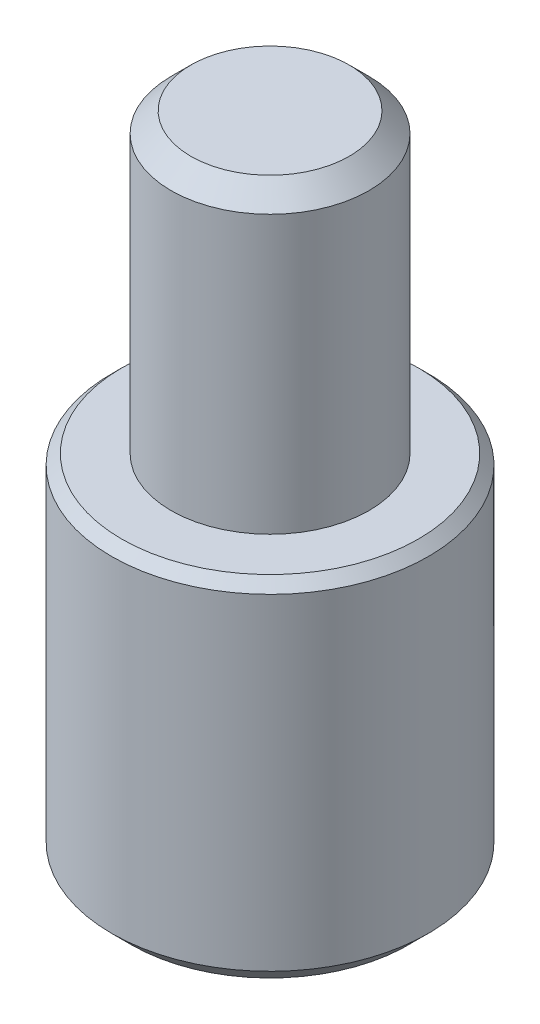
ISO-10303-21;
HEADER;
FILE_DESCRIPTION(('STEP AP214'),'2;1');
FILE_NAME('part.step','',(''),(''),'','','');
FILE_SCHEMA(('AUTOMOTIVE_DESIGN { 1 0 10303 214 1 1 1 1 }'));
ENDSEC;
DATA;
#1=APPLICATION_CONTEXT('core data for automotive mechanical design processes');
#2=APPLICATION_PROTOCOL_DEFINITION('international standard','automotive_design',2000,#1);
#3=PRODUCT_CONTEXT('',#1,'mechanical');
#4=PRODUCT('Part','Part','',(#3));
#5=PRODUCT_RELATED_PRODUCT_CATEGORY('part','',(#4));
#6=PRODUCT_DEFINITION_FORMATION('','',#4);
#7=PRODUCT_DEFINITION_CONTEXT('part definition',#1,'design');
#8=PRODUCT_DEFINITION('design','',#6,#7);
#9=PRODUCT_DEFINITION_SHAPE('','',#8);
#10=(LENGTH_UNIT() NAMED_UNIT(*) SI_UNIT(.MILLI.,.METRE.));
#11=(NAMED_UNIT(*) PLANE_ANGLE_UNIT() SI_UNIT($,.RADIAN.));
#12=(NAMED_UNIT(*) SI_UNIT($,.STERADIAN.) SOLID_ANGLE_UNIT());
#13=UNCERTAINTY_MEASURE_WITH_UNIT(LENGTH_MEASURE(1.E-05),#10,'distance_accuracy_value','');
#14=(GEOMETRIC_REPRESENTATION_CONTEXT(3) GLOBAL_UNCERTAINTY_ASSIGNED_CONTEXT((#13)) GLOBAL_UNIT_ASSIGNED_CONTEXT((#10,
#11,#12)) REPRESENTATION_CONTEXT('',''));
#15=CARTESIAN_POINT('',(0.,0.,0.));
#16=DIRECTION('',(0.,0.,1.));
#17=DIRECTION('',(1.,0.,0.));
#18=AXIS2_PLACEMENT_3D('',#15,#16,#17);
#19=CARTESIAN_POINT('',(0.,9.,0.));
#20=DIRECTION('',(0.,1.,0.));
#21=DIRECTION('',(0.,0.,1.));
#22=AXIS2_PLACEMENT_3D('',#19,#20,#21);
#23=PLANE('',#22);
#24=CARTESIAN_POINT('',(0.,9.,0.));
#25=DIRECTION('',(0.,1.,0.));
#26=DIRECTION('',(0.,0.,1.));
#27=AXIS2_PLACEMENT_3D('',#24,#25,#26);
#28=CIRCLE('',#27,3.746);
#29=CARTESIAN_POINT('',(0.,9.,3.746));
#30=VERTEX_POINT('',#29);
#31=EDGE_CURVE('E145',#30,#30,#28,.T.);
#32=ORIENTED_EDGE('',*,*,#31,.T.);
#33=EDGE_LOOP('',(#32));
#34=FACE_BOUND('',#33,.T.);
#35=CARTESIAN_POINT('',(0.,9.,0.));
#36=DIRECTION('',(0.,1.,0.));
#37=DIRECTION('',(0.,0.,1.));
#38=AXIS2_PLACEMENT_3D('',#35,#36,#37);
#39=CIRCLE('',#38,2.5);
#40=CARTESIAN_POINT('',(0.,9.,2.5));
#41=VERTEX_POINT('',#40);
#42=EDGE_CURVE('E137',#41,#41,#39,.T.);
#43=ORIENTED_EDGE('',*,*,#42,.F.);
#44=EDGE_LOOP('',(#43));
#45=FACE_BOUND('',#44,.T.);
#46=ADVANCED_FACE('F35',(#34,#45),#23,.T.);
#47=CARTESIAN_POINT('',(0.,9.,0.));
#48=DIRECTION('',(0.,-1.,0.));
#49=DIRECTION('',(0.,0.,-1.));
#50=AXIS2_PLACEMENT_3D('',#47,#48,#49);
#51=CYLINDRICAL_SURFACE('',#50,4.);
#52=CARTESIAN_POINT('',(0.,0.5,0.));
#53=DIRECTION('',(0.,1.,0.));
#54=DIRECTION('',(0.,0.,1.));
#55=AXIS2_PLACEMENT_3D('',#52,#53,#54);
#56=CIRCLE('',#55,4.);
#57=CARTESIAN_POINT('',(0.,0.5,4.));
#58=VERTEX_POINT('',#57);
#59=EDGE_CURVE('E151',#58,#58,#56,.T.);
#60=ORIENTED_EDGE('',*,*,#59,.T.);
#61=EDGE_LOOP('',(#60));
#62=FACE_BOUND('',#61,.T.);
#63=CARTESIAN_POINT('',(0.,8.746,0.));
#64=DIRECTION('',(0.,1.,0.));
#65=DIRECTION('',(0.,0.,1.));
#66=AXIS2_PLACEMENT_3D('',#63,#64,#65);
#67=CIRCLE('',#66,4.);
#68=CARTESIAN_POINT('',(0.,8.746,4.));
#69=VERTEX_POINT('',#68);
#70=EDGE_CURVE('E148',#69,#69,#67,.F.);
#71=ORIENTED_EDGE('',*,*,#70,.T.);
#72=EDGE_LOOP('',(#71));
#73=FACE_BOUND('',#72,.T.);
#74=ADVANCED_FACE('F170',(#62,#73),#51,.T.);
#75=CARTESIAN_POINT('',(0.,0.,0.));
#76=DIRECTION('',(0.,1.,0.));
#77=DIRECTION('',(0.,0.,1.));
#78=AXIS2_PLACEMENT_3D('',#75,#76,#77);
#79=PLANE('',#78);
#80=CARTESIAN_POINT('',(0.,0.,0.));
#81=DIRECTION('',(0.,1.,0.));
#82=DIRECTION('',(0.,0.,1.));
#83=AXIS2_PLACEMENT_3D('',#80,#81,#82);
#84=CIRCLE('',#83,3.5);
#85=CARTESIAN_POINT('',(0.,0.,3.5));
#86=VERTEX_POINT('',#85);
#87=EDGE_CURVE('E154',#86,#86,#84,.F.);
#88=ORIENTED_EDGE('',*,*,#87,.T.);
#89=EDGE_LOOP('',(#88));
#90=FACE_BOUND('',#89,.T.);
#91=DIRECTION('',(-1.,0.,0.));
#92=VECTOR('',#91,1.);
#93=CARTESIAN_POINT('',(0.866025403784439,0.,1.5));
#94=LINE('',#93,#92);
#95=CARTESIAN_POINT('',(0.866025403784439,0.,1.5));
#96=VERTEX_POINT('',#95);
#97=CARTESIAN_POINT('',(-0.866025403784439,0.,1.5));
#98=VERTEX_POINT('',#97);
#99=EDGE_CURVE('E124',#96,#98,#94,.T.);
#100=ORIENTED_EDGE('',*,*,#99,.F.);
#101=DIRECTION('',(-0.5,0.,0.866025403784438));
#102=VECTOR('',#101,1.);
#103=CARTESIAN_POINT('',(1.73205080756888,0.,0.));
#104=LINE('',#103,#102);
#105=CARTESIAN_POINT('',(1.73205080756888,0.,0.));
#106=VERTEX_POINT('',#105);
#107=EDGE_CURVE('E50',#106,#96,#104,.T.);
#108=ORIENTED_EDGE('',*,*,#107,.F.);
#109=DIRECTION('',(0.5,0.,0.866025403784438));
#110=VECTOR('',#109,1.);
#111=CARTESIAN_POINT('',(0.866025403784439,0.,-1.5));
#112=LINE('',#111,#110);
#113=CARTESIAN_POINT('',(0.866025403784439,0.,-1.5));
#114=VERTEX_POINT('',#113);
#115=EDGE_CURVE('E133',#114,#106,#112,.T.);
#116=ORIENTED_EDGE('',*,*,#115,.F.);
#117=DIRECTION('',(1.,0.,0.));
#118=VECTOR('',#117,1.);
#119=CARTESIAN_POINT('',(-0.866025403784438,0.,-1.5));
#120=LINE('',#119,#118);
#121=CARTESIAN_POINT('',(-0.866025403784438,0.,-1.5));
#122=VERTEX_POINT('',#121);
#123=EDGE_CURVE('E131',#122,#114,#120,.T.);
#124=ORIENTED_EDGE('',*,*,#123,.F.);
#125=DIRECTION('',(0.5,0.,-0.866025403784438));
#126=VECTOR('',#125,1.);
#127=CARTESIAN_POINT('',(-1.73205080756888,0.,0.));
#128=LINE('',#127,#126);
#129=CARTESIAN_POINT('',(-1.73205080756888,0.,0.));
#130=VERTEX_POINT('',#129);
#131=EDGE_CURVE('E98',#130,#122,#128,.T.);
#132=ORIENTED_EDGE('',*,*,#131,.F.);
#133=DIRECTION('',(-0.5,0.,-0.866025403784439));
#134=VECTOR('',#133,1.);
#135=CARTESIAN_POINT('',(-0.866025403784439,0.,1.5));
#136=LINE('',#135,#134);
#137=EDGE_CURVE('E127',#98,#130,#136,.T.);
#138=ORIENTED_EDGE('',*,*,#137,.F.);
#139=EDGE_LOOP('',(#100,#108,#116,#124,#132,#138));
#140=FACE_BOUND('',#139,.T.);
#141=ADVANCED_FACE('F176',(#90,#140),#79,.F.);
#142=CARTESIAN_POINT('',(0.,16.5,0.));
#143=DIRECTION('',(0.,-1.,0.));
#144=DIRECTION('',(0.,0.,-1.));
#145=AXIS2_PLACEMENT_3D('',#142,#143,#144);
#146=CYLINDRICAL_SURFACE('',#145,2.5);
#147=CARTESIAN_POINT('',(0.,16.,0.));
#148=DIRECTION('',(0.,1.,0.));
#149=DIRECTION('',(0.,0.,1.));
#150=AXIS2_PLACEMENT_3D('',#147,#148,#149);
#151=CIRCLE('',#150,2.5);
#152=CARTESIAN_POINT('',(0.,16.,2.5));
#153=VERTEX_POINT('',#152);
#154=EDGE_CURVE('E11',#153,#153,#151,.F.);
#155=ORIENTED_EDGE('',*,*,#154,.T.);
#156=EDGE_LOOP('',(#155));
#157=FACE_BOUND('',#156,.T.);
#158=ORIENTED_EDGE('',*,*,#42,.T.);
#159=EDGE_LOOP('',(#158));
#160=FACE_BOUND('',#159,.T.);
#161=ADVANCED_FACE('F182',(#157,#160),#146,.T.);
#162=CARTESIAN_POINT('',(0.,16.5,0.));
#163=DIRECTION('',(0.,1.,0.));
#164=DIRECTION('',(0.,0.,1.));
#165=AXIS2_PLACEMENT_3D('',#162,#163,#164);
#166=PLANE('',#165);
#167=CARTESIAN_POINT('',(0.,16.5,0.));
#168=DIRECTION('',(0.,1.,0.));
#169=DIRECTION('',(0.,0.,1.));
#170=AXIS2_PLACEMENT_3D('',#167,#168,#169);
#171=CIRCLE('',#170,2.);
#172=CARTESIAN_POINT('',(0.,16.5,2.));
#173=VERTEX_POINT('',#172);
#174=EDGE_CURVE('E43',#173,#173,#171,.T.);
#175=ORIENTED_EDGE('',*,*,#174,.T.);
#176=EDGE_LOOP('',(#175));
#177=FACE_BOUND('',#176,.T.);
#178=ADVANCED_FACE('F159',(#177),#166,.T.);
#179=CARTESIAN_POINT('',(0.,9.,0.));
#180=DIRECTION('',(0.,-1.,0.));
#181=DIRECTION('',(0.,0.,-1.));
#182=AXIS2_PLACEMENT_3D('',#179,#180,#181);
#183=CONICAL_SURFACE('',#182,3.746,0.785398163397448);
#184=ORIENTED_EDGE('',*,*,#70,.F.);
#185=EDGE_LOOP('',(#184));
#186=FACE_BOUND('',#185,.T.);
#187=ORIENTED_EDGE('',*,*,#31,.F.);
#188=EDGE_LOOP('',(#187));
#189=FACE_BOUND('',#188,.T.);
#190=ADVANCED_FACE('F187',(#186,#189),#183,.T.);
#191=CARTESIAN_POINT('',(1.73205080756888,3.3,0.));
#192=DIRECTION('',(0.866025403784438,0.,0.5));
#193=DIRECTION('',(0.5,0.,-0.866025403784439));
#194=AXIS2_PLACEMENT_3D('',#191,#192,#193);
#195=PLANE('',#194);
#196=ORIENTED_EDGE('',*,*,#107,.T.);
#197=DIRECTION('',(0.,-1.,0.));
#198=VECTOR('',#197,1.);
#199=CARTESIAN_POINT('',(0.866025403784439,3.3,1.5));
#200=LINE('',#199,#198);
#201=CARTESIAN_POINT('',(0.866025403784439,3.3,1.5));
#202=VERTEX_POINT('',#201);
#203=EDGE_CURVE('E80',#202,#96,#200,.T.);
#204=ORIENTED_EDGE('',*,*,#203,.F.);
#205=DIRECTION('',(-0.5,0.,0.866025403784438));
#206=VECTOR('',#205,1.);
#207=CARTESIAN_POINT('',(1.73205080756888,3.3,0.));
#208=LINE('',#207,#206);
#209=CARTESIAN_POINT('',(1.73205080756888,3.3,0.));
#210=VERTEX_POINT('',#209);
#211=EDGE_CURVE('E135',#210,#202,#208,.T.);
#212=ORIENTED_EDGE('',*,*,#211,.F.);
#213=DIRECTION('',(0.,-1.,0.));
#214=VECTOR('',#213,1.);
#215=CARTESIAN_POINT('',(1.73205080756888,3.3,0.));
#216=LINE('',#215,#214);
#217=EDGE_CURVE('E58',#210,#106,#216,.T.);
#218=ORIENTED_EDGE('',*,*,#217,.T.);
#219=EDGE_LOOP('',(#196,#204,#212,#218));
#220=FACE_BOUND('',#219,.T.);
#221=ADVANCED_FACE('F189',(#220),#195,.F.);
#222=CARTESIAN_POINT('',(0.866025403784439,3.3,-1.5));
#223=DIRECTION('',(0.866025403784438,0.,-0.5));
#224=DIRECTION('',(-0.5,0.,-0.866025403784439));
#225=AXIS2_PLACEMENT_3D('',#222,#223,#224);
#226=PLANE('',#225);
#227=ORIENTED_EDGE('',*,*,#115,.T.);
#228=ORIENTED_EDGE('',*,*,#217,.F.);
#229=DIRECTION('',(0.5,0.,0.866025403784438));
#230=VECTOR('',#229,1.);
#231=CARTESIAN_POINT('',(0.866025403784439,3.3,-1.5));
#232=LINE('',#231,#230);
#233=CARTESIAN_POINT('',(0.866025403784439,3.3,-1.5));
#234=VERTEX_POINT('',#233);
#235=EDGE_CURVE('E110',#234,#210,#232,.T.);
#236=ORIENTED_EDGE('',*,*,#235,.F.);
#237=DIRECTION('',(0.,-1.,0.));
#238=VECTOR('',#237,1.);
#239=CARTESIAN_POINT('',(0.866025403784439,3.3,-1.5));
#240=LINE('',#239,#238);
#241=EDGE_CURVE('E102',#234,#114,#240,.T.);
#242=ORIENTED_EDGE('',*,*,#241,.T.);
#243=EDGE_LOOP('',(#227,#228,#236,#242));
#244=FACE_BOUND('',#243,.T.);
#245=ADVANCED_FACE('F195',(#244),#226,.F.);
#246=CARTESIAN_POINT('',(-0.866025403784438,3.3,-1.5));
#247=DIRECTION('',(0.,0.,-1.));
#248=DIRECTION('',(-1.,0.,0.));
#249=AXIS2_PLACEMENT_3D('',#246,#247,#248);
#250=PLANE('',#249);
#251=ORIENTED_EDGE('',*,*,#123,.T.);
#252=ORIENTED_EDGE('',*,*,#241,.F.);
#253=DIRECTION('',(1.,0.,0.));
#254=VECTOR('',#253,1.);
#255=CARTESIAN_POINT('',(-0.866025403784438,3.3,-1.5));
#256=LINE('',#255,#254);
#257=CARTESIAN_POINT('',(-0.866025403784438,3.3,-1.5));
#258=VERTEX_POINT('',#257);
#259=EDGE_CURVE('E106',#258,#234,#256,.T.);
#260=ORIENTED_EDGE('',*,*,#259,.F.);
#261=DIRECTION('',(0.,-1.,0.));
#262=VECTOR('',#261,1.);
#263=CARTESIAN_POINT('',(-0.866025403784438,3.3,-1.5));
#264=LINE('',#263,#262);
#265=EDGE_CURVE('E91',#258,#122,#264,.T.);
#266=ORIENTED_EDGE('',*,*,#265,.T.);
#267=EDGE_LOOP('',(#251,#252,#260,#266));
#268=FACE_BOUND('',#267,.T.);
#269=ADVANCED_FACE('F107',(#268),#250,.F.);
#270=CARTESIAN_POINT('',(-1.73205080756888,3.3,0.));
#271=DIRECTION('',(-0.866025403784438,0.,-0.5));
#272=DIRECTION('',(-0.5,0.,0.866025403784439));
#273=AXIS2_PLACEMENT_3D('',#270,#271,#272);
#274=PLANE('',#273);
#275=ORIENTED_EDGE('',*,*,#131,.T.);
#276=ORIENTED_EDGE('',*,*,#265,.F.);
#277=DIRECTION('',(0.5,0.,-0.866025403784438));
#278=VECTOR('',#277,1.);
#279=CARTESIAN_POINT('',(-1.73205080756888,3.3,0.));
#280=LINE('',#279,#278);
#281=CARTESIAN_POINT('',(-1.73205080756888,3.3,0.));
#282=VERTEX_POINT('',#281);
#283=EDGE_CURVE('E95',#282,#258,#280,.T.);
#284=ORIENTED_EDGE('',*,*,#283,.F.);
#285=DIRECTION('',(0.,-1.,0.));
#286=VECTOR('',#285,1.);
#287=CARTESIAN_POINT('',(-1.73205080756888,3.3,0.));
#288=LINE('',#287,#286);
#289=EDGE_CURVE('E103',#282,#130,#288,.T.);
#290=ORIENTED_EDGE('',*,*,#289,.T.);
#291=EDGE_LOOP('',(#275,#276,#284,#290));
#292=FACE_BOUND('',#291,.T.);
#293=ADVANCED_FACE('F93',(#292),#274,.F.);
#294=CARTESIAN_POINT('',(-0.866025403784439,3.3,1.5));
#295=DIRECTION('',(-0.866025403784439,0.,0.5));
#296=DIRECTION('',(0.5,0.,0.866025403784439));
#297=AXIS2_PLACEMENT_3D('',#294,#295,#296);
#298=PLANE('',#297);
#299=ORIENTED_EDGE('',*,*,#137,.T.);
#300=ORIENTED_EDGE('',*,*,#289,.F.);
#301=DIRECTION('',(-0.5,0.,-0.866025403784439));
#302=VECTOR('',#301,1.);
#303=CARTESIAN_POINT('',(-0.866025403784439,3.3,1.5));
#304=LINE('',#303,#302);
#305=CARTESIAN_POINT('',(-0.866025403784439,3.3,1.5));
#306=VERTEX_POINT('',#305);
#307=EDGE_CURVE('E116',#306,#282,#304,.T.);
#308=ORIENTED_EDGE('',*,*,#307,.F.);
#309=DIRECTION('',(0.,-1.,0.));
#310=VECTOR('',#309,1.);
#311=CARTESIAN_POINT('',(-0.866025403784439,3.3,1.5));
#312=LINE('',#311,#310);
#313=EDGE_CURVE('E140',#306,#98,#312,.T.);
#314=ORIENTED_EDGE('',*,*,#313,.T.);
#315=EDGE_LOOP('',(#299,#300,#308,#314));
#316=FACE_BOUND('',#315,.T.);
#317=ADVANCED_FACE('F209',(#316),#298,.F.);
#318=CARTESIAN_POINT('',(0.866025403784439,3.3,1.5));
#319=DIRECTION('',(0.,0.,1.));
#320=DIRECTION('',(1.,0.,0.));
#321=AXIS2_PLACEMENT_3D('',#318,#319,#320);
#322=PLANE('',#321);
#323=ORIENTED_EDGE('',*,*,#99,.T.);
#324=ORIENTED_EDGE('',*,*,#313,.F.);
#325=DIRECTION('',(-1.,0.,0.));
#326=VECTOR('',#325,1.);
#327=CARTESIAN_POINT('',(0.866025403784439,3.3,1.5));
#328=LINE('',#327,#326);
#329=EDGE_CURVE('E118',#202,#306,#328,.T.);
#330=ORIENTED_EDGE('',*,*,#329,.F.);
#331=ORIENTED_EDGE('',*,*,#203,.T.);
#332=EDGE_LOOP('',(#323,#324,#330,#331));
#333=FACE_BOUND('',#332,.T.);
#334=ADVANCED_FACE('F206',(#333),#322,.F.);
#335=CARTESIAN_POINT('',(0.866025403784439,3.3,1.5));
#336=DIRECTION('',(0.,-1.,0.));
#337=DIRECTION('',(0.,0.,-1.));
#338=AXIS2_PLACEMENT_3D('',#335,#336,#337);
#339=PLANE('',#338);
#340=ORIENTED_EDGE('',*,*,#211,.T.);
#341=ORIENTED_EDGE('',*,*,#329,.T.);
#342=ORIENTED_EDGE('',*,*,#307,.T.);
#343=ORIENTED_EDGE('',*,*,#283,.T.);
#344=ORIENTED_EDGE('',*,*,#259,.T.);
#345=ORIENTED_EDGE('',*,*,#235,.T.);
#346=EDGE_LOOP('',(#340,#341,#342,#343,#344,#345));
#347=FACE_BOUND('',#346,.T.);
#348=ADVANCED_FACE('F113',(#347),#339,.T.);
#349=CARTESIAN_POINT('',(0.,0.5,0.));
#350=DIRECTION('',(0.,1.,0.));
#351=DIRECTION('',(0.,0.,1.));
#352=AXIS2_PLACEMENT_3D('',#349,#350,#351);
#353=CONICAL_SURFACE('',#352,4.,0.78539816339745);
#354=ORIENTED_EDGE('',*,*,#87,.F.);
#355=EDGE_LOOP('',(#354));
#356=FACE_BOUND('',#355,.T.);
#357=ORIENTED_EDGE('',*,*,#59,.F.);
#358=EDGE_LOOP('',(#357));
#359=FACE_BOUND('',#358,.T.);
#360=ADVANCED_FACE('F162',(#356,#359),#353,.T.);
#361=CARTESIAN_POINT('',(0.,16.5,0.));
#362=DIRECTION('',(0.,-1.,0.));
#363=DIRECTION('',(0.,0.,-1.));
#364=AXIS2_PLACEMENT_3D('',#361,#362,#363);
#365=CONICAL_SURFACE('',#364,2.,0.785398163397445);
#366=ORIENTED_EDGE('',*,*,#154,.F.);
#367=EDGE_LOOP('',(#366));
#368=FACE_BOUND('',#367,.T.);
#369=ORIENTED_EDGE('',*,*,#174,.F.);
#370=EDGE_LOOP('',(#369));
#371=FACE_BOUND('',#370,.T.);
#372=ADVANCED_FACE('F37',(#368,#371),#365,.T.);
#373=CLOSED_SHELL('',(#46,#74,#141,#161,#178,#190,#221,#245,#269,#293,#317,#334,#348,#360,#372));
#374=MANIFOLD_SOLID_BREP('B2',#373);
#375=ADVANCED_BREP_SHAPE_REPRESENTATION('',(#18,#374),#14);
#376=SHAPE_DEFINITION_REPRESENTATION(#9,#375);
ENDSEC;
END-ISO-10303-21;
